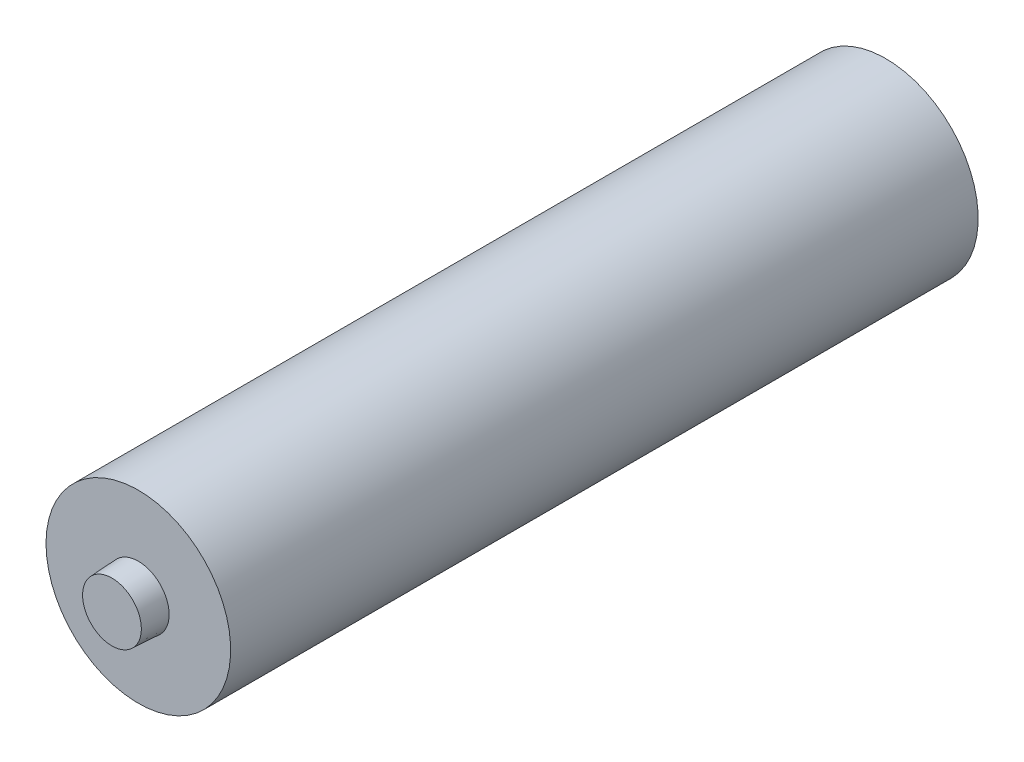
from build123d import *

# Parameters (mm, degrees)
ESQUISSE1_R      = 5.25
EXTRUSION1_DEPTH = 42.5
ESQUISSE2_R      = 1.75
EXTRUSION2_DEPTH = 1.5
EXTRUSION2_TAPER = 3


with BuildPart() as part:
    # Esquisse1 → Extrusion1 (new body)
    with BuildSketch(Plane.XY):
        with Locations(Location((0, 0, 0), (0, 0, 180))):
            Circle(ESQUISSE1_R)
    extrude(amount=EXTRUSION1_DEPTH)

    # Esquisse2 → Extrusion2 (add)
    with BuildSketch(Plane.XY.offset(42.5)):
        Circle(ESQUISSE2_R)
    extrude(amount=EXTRUSION2_DEPTH, taper=EXTRUSION2_TAPER)


solid = part.part
